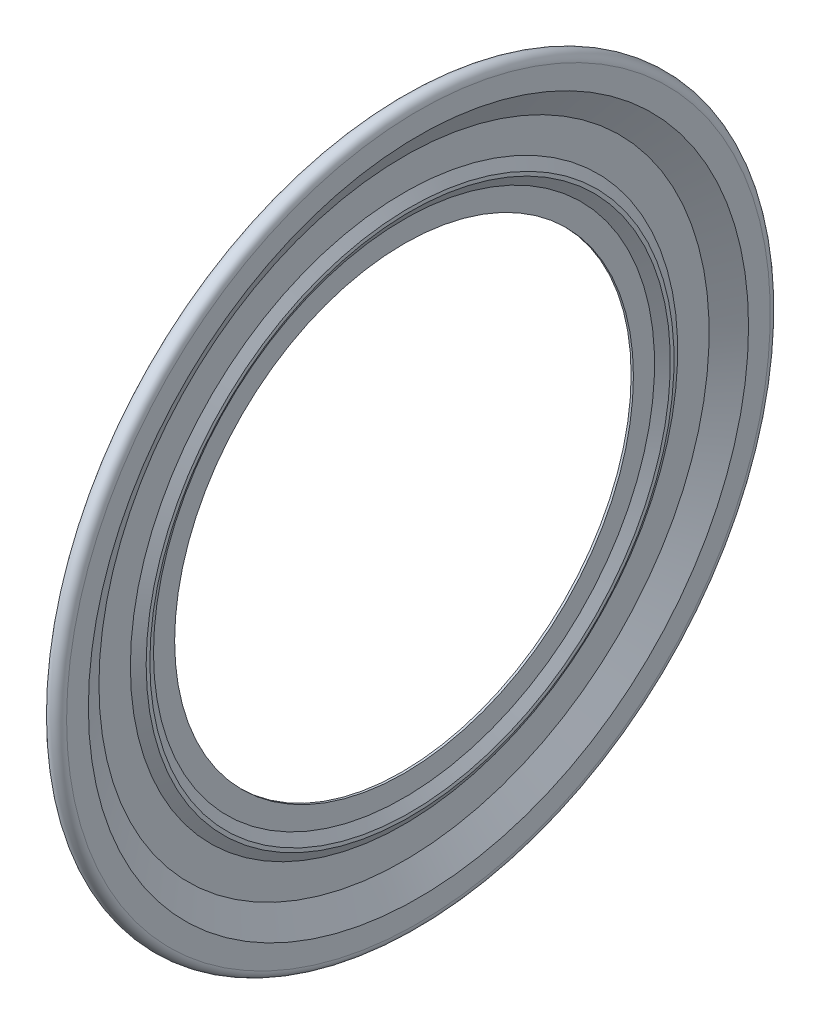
ISO-10303-21;
HEADER;
FILE_DESCRIPTION(('STEP AP214'),'2;1');
FILE_NAME('part.step','',(''),(''),'','','');
FILE_SCHEMA(('AUTOMOTIVE_DESIGN { 1 0 10303 214 1 1 1 1 }'));
ENDSEC;
DATA;
#1=APPLICATION_CONTEXT('core data for automotive mechanical design processes');
#2=APPLICATION_PROTOCOL_DEFINITION('international standard','automotive_design',2000,#1);
#3=PRODUCT_CONTEXT('',#1,'mechanical');
#4=PRODUCT('Part','Part','',(#3));
#5=PRODUCT_RELATED_PRODUCT_CATEGORY('part','',(#4));
#6=PRODUCT_DEFINITION_FORMATION('','',#4);
#7=PRODUCT_DEFINITION_CONTEXT('part definition',#1,'design');
#8=PRODUCT_DEFINITION('design','',#6,#7);
#9=PRODUCT_DEFINITION_SHAPE('','',#8);
#10=(LENGTH_UNIT() NAMED_UNIT(*) SI_UNIT(.MILLI.,.METRE.));
#11=(NAMED_UNIT(*) PLANE_ANGLE_UNIT() SI_UNIT($,.RADIAN.));
#12=(NAMED_UNIT(*) SI_UNIT($,.STERADIAN.) SOLID_ANGLE_UNIT());
#13=UNCERTAINTY_MEASURE_WITH_UNIT(LENGTH_MEASURE(1.E-05),#10,'distance_accuracy_value','');
#14=(GEOMETRIC_REPRESENTATION_CONTEXT(3) GLOBAL_UNCERTAINTY_ASSIGNED_CONTEXT((#13)) GLOBAL_UNIT_ASSIGNED_CONTEXT((#10,
#11,#12)) REPRESENTATION_CONTEXT('',''));
#15=CARTESIAN_POINT('',(0.,0.,0.));
#16=DIRECTION('',(0.,0.,1.));
#17=DIRECTION('',(1.,0.,0.));
#18=AXIS2_PLACEMENT_3D('',#15,#16,#17);
#19=CARTESIAN_POINT('',(0.183333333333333,0.,0.));
#20=DIRECTION('',(1.,0.,0.));
#21=DIRECTION('',(0.,0.,-1.));
#22=AXIS2_PLACEMENT_3D('',#19,#20,#21);
#23=CONICAL_SURFACE('',#22,13.4182689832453,1.0471975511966);
#24=CARTESIAN_POINT('',(0.816666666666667,0.,0.));
#25=DIRECTION('',(-1.,0.,0.));
#26=DIRECTION('',(0.,0.,1.));
#27=AXIS2_PLACEMENT_3D('',#24,#25,#26);
#28=CIRCLE('',#27,14.5152344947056);
#29=CARTESIAN_POINT('',(0.816666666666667,0.,14.5152344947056));
#30=VERTEX_POINT('',#29);
#31=EDGE_CURVE('E10',#30,#30,#28,.T.);
#32=ORIENTED_EDGE('',*,*,#31,.T.);
#33=EDGE_LOOP('',(#32));
#34=FACE_BOUND('',#33,.T.);
#35=CARTESIAN_POINT('',(0.183333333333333,0.,0.));
#36=DIRECTION('',(-1.,0.,0.));
#37=DIRECTION('',(0.,0.,1.));
#38=AXIS2_PLACEMENT_3D('',#35,#36,#37);
#39=CIRCLE('',#38,13.4182689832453);
#40=CARTESIAN_POINT('',(0.183333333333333,0.,13.4182689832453));
#41=VERTEX_POINT('',#40);
#42=EDGE_CURVE('E92',#41,#41,#39,.T.);
#43=ORIENTED_EDGE('',*,*,#42,.F.);
#44=EDGE_LOOP('',(#43));
#45=FACE_BOUND('',#44,.T.);
#46=ADVANCED_FACE('F28',(#34,#45),#23,.T.);
#47=CARTESIAN_POINT('',(0.816666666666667,14.5152344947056,0.));
#48=DIRECTION('',(-1.,0.,0.));
#49=DIRECTION('',(0.,0.,1.));
#50=AXIS2_PLACEMENT_3D('',#47,#48,#49);
#51=PLANE('',#50);
#52=CARTESIAN_POINT('',(0.816666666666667,0.,0.));
#53=DIRECTION('',(-1.,0.,0.));
#54=DIRECTION('',(0.,0.,1.));
#55=AXIS2_PLACEMENT_3D('',#52,#53,#54);
#56=CIRCLE('',#55,15.4441526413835);
#57=CARTESIAN_POINT('',(0.816666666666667,0.,15.4441526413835));
#58=VERTEX_POINT('',#57);
#59=EDGE_CURVE('E34',#58,#58,#56,.T.);
#60=ORIENTED_EDGE('',*,*,#59,.T.);
#61=EDGE_LOOP('',(#60));
#62=FACE_BOUND('',#61,.T.);
#63=ORIENTED_EDGE('',*,*,#31,.F.);
#64=EDGE_LOOP('',(#63));
#65=FACE_BOUND('',#64,.T.);
#66=ADVANCED_FACE('F100',(#62,#65),#51,.T.);
#67=CARTESIAN_POINT('',(0.55,0.,0.));
#68=DIRECTION('',(-1.,0.,0.));
#69=DIRECTION('',(0.,0.,1.));
#70=AXIS2_PLACEMENT_3D('',#67,#68,#69);
#71=TOROIDAL_SURFACE('',#70,15.4441526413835,0.266666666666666);
#72=CARTESIAN_POINT('',(0.283333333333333,0.,0.));
#73=DIRECTION('',(-1.,0.,0.));
#74=DIRECTION('',(0.,0.,1.));
#75=AXIS2_PLACEMENT_3D('',#72,#73,#74);
#76=CIRCLE('',#75,15.4441526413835);
#77=CARTESIAN_POINT('',(0.283333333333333,0.,15.4441526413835));
#78=VERTEX_POINT('',#77);
#79=EDGE_CURVE('E38',#78,#78,#76,.T.);
#80=ORIENTED_EDGE('',*,*,#79,.T.);
#81=EDGE_LOOP('',(#80));
#82=FACE_BOUND('',#81,.T.);
#83=ORIENTED_EDGE('',*,*,#59,.F.);
#84=EDGE_LOOP('',(#83));
#85=FACE_BOUND('',#84,.T.);
#86=ADVANCED_FACE('F104',(#82,#85),#71,.F.);
#87=CARTESIAN_POINT('',(0.283333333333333,15.4441526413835,0.));
#88=DIRECTION('',(1.,0.,0.));
#89=DIRECTION('',(0.,0.,-1.));
#90=AXIS2_PLACEMENT_3D('',#87,#88,#89);
#91=PLANE('',#90);
#92=CARTESIAN_POINT('',(0.283333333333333,0.,0.));
#93=DIRECTION('',(-1.,0.,0.));
#94=DIRECTION('',(0.,0.,1.));
#95=AXIS2_PLACEMENT_3D('',#92,#93,#94);
#96=CIRCLE('',#95,14.3752891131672);
#97=CARTESIAN_POINT('',(0.283333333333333,0.,14.3752891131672));
#98=VERTEX_POINT('',#97);
#99=EDGE_CURVE('E42',#98,#98,#96,.T.);
#100=ORIENTED_EDGE('',*,*,#99,.T.);
#101=EDGE_LOOP('',(#100));
#102=FACE_BOUND('',#101,.T.);
#103=ORIENTED_EDGE('',*,*,#79,.F.);
#104=EDGE_LOOP('',(#103));
#105=FACE_BOUND('',#104,.T.);
#106=ADVANCED_FACE('F108',(#102,#105),#91,.T.);
#107=CARTESIAN_POINT('',(0.,0.,0.));
#108=DIRECTION('',(-1.,0.,0.));
#109=DIRECTION('',(0.,0.,1.));
#110=AXIS2_PLACEMENT_3D('',#107,#108,#109);
#111=CYLINDRICAL_SURFACE('',#110,14.3752891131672);
#112=ORIENTED_EDGE('',*,*,#99,.F.);
#113=EDGE_LOOP('',(#112));
#114=FACE_BOUND('',#113,.T.);
#115=CARTESIAN_POINT('',(0.183333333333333,0.,0.));
#116=DIRECTION('',(-1.,0.,0.));
#117=DIRECTION('',(0.,0.,1.));
#118=AXIS2_PLACEMENT_3D('',#115,#116,#117);
#119=CIRCLE('',#118,14.3752891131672);
#120=CARTESIAN_POINT('',(0.183333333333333,0.,14.3752891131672));
#121=VERTEX_POINT('',#120);
#122=EDGE_CURVE('E47',#121,#121,#119,.T.);
#123=ORIENTED_EDGE('',*,*,#122,.T.);
#124=EDGE_LOOP('',(#123));
#125=FACE_BOUND('',#124,.T.);
#126=ADVANCED_FACE('F115',(#114,#125),#111,.F.);
#127=CARTESIAN_POINT('',(0.183333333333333,15.4441526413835,0.));
#128=DIRECTION('',(1.,0.,0.));
#129=DIRECTION('',(0.,0.,-1.));
#130=AXIS2_PLACEMENT_3D('',#127,#128,#129);
#131=PLANE('',#130);
#132=ORIENTED_EDGE('',*,*,#122,.F.);
#133=EDGE_LOOP('',(#132));
#134=FACE_BOUND('',#133,.T.);
#135=CARTESIAN_POINT('',(0.183333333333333,0.,0.));
#136=DIRECTION('',(-1.,0.,0.));
#137=DIRECTION('',(0.,0.,1.));
#138=AXIS2_PLACEMENT_3D('',#135,#136,#137);
#139=CIRCLE('',#138,15.4441526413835);
#140=CARTESIAN_POINT('',(0.183333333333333,0.,15.4441526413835));
#141=VERTEX_POINT('',#140);
#142=EDGE_CURVE('E50',#141,#141,#139,.T.);
#143=ORIENTED_EDGE('',*,*,#142,.T.);
#144=EDGE_LOOP('',(#143));
#145=FACE_BOUND('',#144,.T.);
#146=ADVANCED_FACE('F119',(#134,#145),#131,.F.);
#147=CARTESIAN_POINT('',(0.55,0.,0.));
#148=DIRECTION('',(-1.,0.,0.));
#149=DIRECTION('',(0.,0.,1.));
#150=AXIS2_PLACEMENT_3D('',#147,#148,#149);
#151=TOROIDAL_SURFACE('',#150,15.4441526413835,0.366666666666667);
#152=ORIENTED_EDGE('',*,*,#142,.F.);
#153=EDGE_LOOP('',(#152));
#154=FACE_BOUND('',#153,.T.);
#155=CARTESIAN_POINT('',(0.916666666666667,0.,0.));
#156=DIRECTION('',(-1.,0.,0.));
#157=DIRECTION('',(0.,0.,1.));
#158=AXIS2_PLACEMENT_3D('',#155,#156,#157);
#159=CIRCLE('',#158,15.4441526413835);
#160=CARTESIAN_POINT('',(0.916666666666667,0.,15.4441526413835));
#161=VERTEX_POINT('',#160);
#162=EDGE_CURVE('E53',#161,#161,#159,.T.);
#163=ORIENTED_EDGE('',*,*,#162,.T.);
#164=EDGE_LOOP('',(#163));
#165=FACE_BOUND('',#164,.T.);
#166=ADVANCED_FACE('F123',(#154,#165),#151,.T.);
#167=CARTESIAN_POINT('',(0.916666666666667,15.4441526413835,0.));
#168=DIRECTION('',(1.,0.,0.));
#169=DIRECTION('',(0.,0.,-1.));
#170=AXIS2_PLACEMENT_3D('',#167,#168,#169);
#171=PLANE('',#170);
#172=CARTESIAN_POINT('',(0.916666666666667,0.,0.));
#173=DIRECTION('',(-1.,0.,0.));
#174=DIRECTION('',(0.,0.,1.));
#175=AXIS2_PLACEMENT_3D('',#172,#173,#174);
#176=CIRCLE('',#175,14.4884395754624);
#177=CARTESIAN_POINT('',(0.916666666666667,0.,14.4884395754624));
#178=VERTEX_POINT('',#177);
#179=EDGE_CURVE('E56',#178,#178,#176,.T.);
#180=ORIENTED_EDGE('',*,*,#179,.T.);
#181=EDGE_LOOP('',(#180));
#182=FACE_BOUND('',#181,.T.);
#183=ORIENTED_EDGE('',*,*,#162,.F.);
#184=EDGE_LOOP('',(#183));
#185=FACE_BOUND('',#184,.T.);
#186=ADVANCED_FACE('F127',(#182,#185),#171,.T.);
#187=CARTESIAN_POINT('',(0.916666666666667,0.,0.));
#188=DIRECTION('',(1.,0.,0.));
#189=DIRECTION('',(0.,0.,-1.));
#190=AXIS2_PLACEMENT_3D('',#187,#188,#189);
#191=CONICAL_SURFACE('',#190,14.4884395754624,1.0471975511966);
#192=CARTESIAN_POINT('',(0.283333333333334,0.,0.));
#193=DIRECTION('',(-1.,0.,0.));
#194=DIRECTION('',(0.,0.,1.));
#195=AXIS2_PLACEMENT_3D('',#192,#193,#194);
#196=CIRCLE('',#195,13.3914740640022);
#197=CARTESIAN_POINT('',(0.283333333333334,0.,13.3914740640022));
#198=VERTEX_POINT('',#197);
#199=EDGE_CURVE('E59',#198,#198,#196,.T.);
#200=ORIENTED_EDGE('',*,*,#199,.T.);
#201=EDGE_LOOP('',(#200));
#202=FACE_BOUND('',#201,.T.);
#203=ORIENTED_EDGE('',*,*,#179,.F.);
#204=EDGE_LOOP('',(#203));
#205=FACE_BOUND('',#204,.T.);
#206=ADVANCED_FACE('F131',(#202,#205),#191,.F.);
#207=CARTESIAN_POINT('',(0.283333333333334,13.3914740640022,0.));
#208=DIRECTION('',(1.,0.,0.));
#209=DIRECTION('',(0.,0.,-1.));
#210=AXIS2_PLACEMENT_3D('',#207,#208,#209);
#211=PLANE('',#210);
#212=CARTESIAN_POINT('',(0.283333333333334,0.,0.));
#213=DIRECTION('',(-1.,0.,0.));
#214=DIRECTION('',(0.,0.,1.));
#215=AXIS2_PLACEMENT_3D('',#212,#213,#214);
#216=CIRCLE('',#215,12.0114542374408);
#217=CARTESIAN_POINT('',(0.283333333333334,0.,12.0114542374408));
#218=VERTEX_POINT('',#217);
#219=EDGE_CURVE('E62',#218,#218,#216,.T.);
#220=ORIENTED_EDGE('',*,*,#219,.T.);
#221=EDGE_LOOP('',(#220));
#222=FACE_BOUND('',#221,.T.);
#223=ORIENTED_EDGE('',*,*,#199,.F.);
#224=EDGE_LOOP('',(#223));
#225=FACE_BOUND('',#224,.T.);
#226=ADVANCED_FACE('F135',(#222,#225),#211,.T.);
#227=CARTESIAN_POINT('',(0.283333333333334,0.,0.));
#228=DIRECTION('',(-1.,0.,0.));
#229=DIRECTION('',(0.,0.,1.));
#230=AXIS2_PLACEMENT_3D('',#227,#228,#229);
#231=CONICAL_SURFACE('',#230,12.0114542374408,1.01153500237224);
#232=CARTESIAN_POINT('',(0.55,0.,0.));
#233=DIRECTION('',(-1.,0.,0.));
#234=DIRECTION('',(0.,0.,1.));
#235=AXIS2_PLACEMENT_3D('',#232,#233,#234);
#236=CIRCLE('',#235,11.5854153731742);
#237=CARTESIAN_POINT('',(0.55,0.,11.5854153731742));
#238=VERTEX_POINT('',#237);
#239=EDGE_CURVE('E65',#238,#238,#236,.T.);
#240=ORIENTED_EDGE('',*,*,#239,.T.);
#241=EDGE_LOOP('',(#240));
#242=FACE_BOUND('',#241,.T.);
#243=ORIENTED_EDGE('',*,*,#219,.F.);
#244=EDGE_LOOP('',(#243));
#245=FACE_BOUND('',#244,.T.);
#246=ADVANCED_FACE('F139',(#242,#245),#231,.T.);
#247=CARTESIAN_POINT('',(0.55,11.5854153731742,0.));
#248=DIRECTION('',(1.,0.,0.));
#249=DIRECTION('',(0.,0.,-1.));
#250=AXIS2_PLACEMENT_3D('',#247,#248,#249);
#251=PLANE('',#250);
#252=CARTESIAN_POINT('',(0.55,0.,0.));
#253=DIRECTION('',(-1.,0.,0.));
#254=DIRECTION('',(0.,0.,1.));
#255=AXIS2_PLACEMENT_3D('',#252,#253,#254);
#256=CIRCLE('',#255,11.4230420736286);
#257=CARTESIAN_POINT('',(0.55,0.,11.4230420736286));
#258=VERTEX_POINT('',#257);
#259=EDGE_CURVE('E68',#258,#258,#256,.T.);
#260=ORIENTED_EDGE('',*,*,#259,.T.);
#261=EDGE_LOOP('',(#260));
#262=FACE_BOUND('',#261,.T.);
#263=ORIENTED_EDGE('',*,*,#239,.F.);
#264=EDGE_LOOP('',(#263));
#265=FACE_BOUND('',#264,.T.);
#266=ADVANCED_FACE('F143',(#262,#265),#251,.T.);
#267=CARTESIAN_POINT('',(0.55,0.,0.));
#268=DIRECTION('',(1.,0.,0.));
#269=DIRECTION('',(0.,0.,-1.));
#270=AXIS2_PLACEMENT_3D('',#267,#268,#269);
#271=CONICAL_SURFACE('',#270,11.4230420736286,1.01153500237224);
#272=CARTESIAN_POINT('',(0.283333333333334,0.,0.));
#273=DIRECTION('',(-1.,0.,0.));
#274=DIRECTION('',(0.,0.,1.));
#275=AXIS2_PLACEMENT_3D('',#272,#273,#274);
#276=CIRCLE('',#275,10.997003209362);
#277=CARTESIAN_POINT('',(0.283333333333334,0.,10.997003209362));
#278=VERTEX_POINT('',#277);
#279=EDGE_CURVE('E71',#278,#278,#276,.T.);
#280=ORIENTED_EDGE('',*,*,#279,.T.);
#281=EDGE_LOOP('',(#280));
#282=FACE_BOUND('',#281,.T.);
#283=ORIENTED_EDGE('',*,*,#259,.F.);
#284=EDGE_LOOP('',(#283));
#285=FACE_BOUND('',#284,.T.);
#286=ADVANCED_FACE('F147',(#282,#285),#271,.F.);
#287=CARTESIAN_POINT('',(0.283333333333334,10.997003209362,0.));
#288=DIRECTION('',(1.,0.,0.));
#289=DIRECTION('',(0.,0.,-1.));
#290=AXIS2_PLACEMENT_3D('',#287,#288,#289);
#291=PLANE('',#290);
#292=CARTESIAN_POINT('',(0.283333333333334,0.,0.));
#293=DIRECTION('',(-1.,0.,0.));
#294=DIRECTION('',(0.,0.,1.));
#295=AXIS2_PLACEMENT_3D('',#292,#293,#294);
#296=CIRCLE('',#295,10.0686985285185);
#297=CARTESIAN_POINT('',(0.283333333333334,0.,10.0686985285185));
#298=VERTEX_POINT('',#297);
#299=EDGE_CURVE('E74',#298,#298,#296,.T.);
#300=ORIENTED_EDGE('',*,*,#299,.T.);
#301=EDGE_LOOP('',(#300));
#302=FACE_BOUND('',#301,.T.);
#303=ORIENTED_EDGE('',*,*,#279,.F.);
#304=EDGE_LOOP('',(#303));
#305=FACE_BOUND('',#304,.T.);
#306=ADVANCED_FACE('F151',(#302,#305),#291,.T.);
#307=CARTESIAN_POINT('',(0.,0.,0.));
#308=DIRECTION('',(-1.,0.,0.));
#309=DIRECTION('',(0.,0.,1.));
#310=AXIS2_PLACEMENT_3D('',#307,#308,#309);
#311=CYLINDRICAL_SURFACE('',#310,10.0686985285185);
#312=CARTESIAN_POINT('',(0.183333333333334,0.,0.));
#313=DIRECTION('',(-1.,0.,0.));
#314=DIRECTION('',(0.,0.,1.));
#315=AXIS2_PLACEMENT_3D('',#312,#313,#314);
#316=CIRCLE('',#315,10.0686985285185);
#317=CARTESIAN_POINT('',(0.183333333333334,0.,10.0686985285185));
#318=VERTEX_POINT('',#317);
#319=EDGE_CURVE('E77',#318,#318,#316,.T.);
#320=ORIENTED_EDGE('',*,*,#319,.T.);
#321=EDGE_LOOP('',(#320));
#322=FACE_BOUND('',#321,.T.);
#323=ORIENTED_EDGE('',*,*,#299,.F.);
#324=EDGE_LOOP('',(#323));
#325=FACE_BOUND('',#324,.T.);
#326=ADVANCED_FACE('F155',(#322,#325),#311,.F.);
#327=CARTESIAN_POINT('',(0.183333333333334,10.0686985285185,0.));
#328=DIRECTION('',(-1.,0.,0.));
#329=DIRECTION('',(0.,0.,1.));
#330=AXIS2_PLACEMENT_3D('',#327,#328,#329);
#331=PLANE('',#330);
#332=CARTESIAN_POINT('',(0.183333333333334,0.,0.));
#333=DIRECTION('',(-1.,0.,0.));
#334=DIRECTION('',(0.,0.,1.));
#335=AXIS2_PLACEMENT_3D('',#332,#333,#334);
#336=CIRCLE('',#335,11.0257186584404);
#337=CARTESIAN_POINT('',(0.183333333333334,0.,11.0257186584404));
#338=VERTEX_POINT('',#337);
#339=EDGE_CURVE('E80',#338,#338,#336,.T.);
#340=ORIENTED_EDGE('',*,*,#339,.T.);
#341=EDGE_LOOP('',(#340));
#342=FACE_BOUND('',#341,.T.);
#343=ORIENTED_EDGE('',*,*,#319,.F.);
#344=EDGE_LOOP('',(#343));
#345=FACE_BOUND('',#344,.T.);
#346=ADVANCED_FACE('F159',(#342,#345),#331,.T.);
#347=CARTESIAN_POINT('',(0.183333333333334,0.,0.));
#348=DIRECTION('',(1.,0.,0.));
#349=DIRECTION('',(0.,0.,-1.));
#350=AXIS2_PLACEMENT_3D('',#347,#348,#349);
#351=CONICAL_SURFACE('',#350,11.0257186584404,1.01153500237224);
#352=CARTESIAN_POINT('',(0.45,0.,0.));
#353=DIRECTION('',(-1.,0.,0.));
#354=DIRECTION('',(0.,0.,1.));
#355=AXIS2_PLACEMENT_3D('',#352,#353,#354);
#356=CIRCLE('',#355,11.4517575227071);
#357=CARTESIAN_POINT('',(0.45,0.,11.4517575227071));
#358=VERTEX_POINT('',#357);
#359=EDGE_CURVE('E83',#358,#358,#356,.T.);
#360=ORIENTED_EDGE('',*,*,#359,.T.);
#361=EDGE_LOOP('',(#360));
#362=FACE_BOUND('',#361,.T.);
#363=ORIENTED_EDGE('',*,*,#339,.F.);
#364=EDGE_LOOP('',(#363));
#365=FACE_BOUND('',#364,.T.);
#366=ADVANCED_FACE('F163',(#362,#365),#351,.T.);
#367=CARTESIAN_POINT('',(0.45,11.4517575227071,0.));
#368=DIRECTION('',(-1.,0.,0.));
#369=DIRECTION('',(0.,0.,1.));
#370=AXIS2_PLACEMENT_3D('',#367,#368,#369);
#371=PLANE('',#370);
#372=CARTESIAN_POINT('',(0.45,0.,0.));
#373=DIRECTION('',(-1.,0.,0.));
#374=DIRECTION('',(0.,0.,1.));
#375=AXIS2_PLACEMENT_3D('',#372,#373,#374);
#376=CIRCLE('',#375,11.5566999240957);
#377=CARTESIAN_POINT('',(0.45,0.,11.5566999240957));
#378=VERTEX_POINT('',#377);
#379=EDGE_CURVE('E86',#378,#378,#376,.T.);
#380=ORIENTED_EDGE('',*,*,#379,.T.);
#381=EDGE_LOOP('',(#380));
#382=FACE_BOUND('',#381,.T.);
#383=ORIENTED_EDGE('',*,*,#359,.F.);
#384=EDGE_LOOP('',(#383));
#385=FACE_BOUND('',#384,.T.);
#386=ADVANCED_FACE('F167',(#382,#385),#371,.T.);
#387=CARTESIAN_POINT('',(0.45,0.,0.));
#388=DIRECTION('',(-1.,0.,0.));
#389=DIRECTION('',(0.,0.,1.));
#390=AXIS2_PLACEMENT_3D('',#387,#388,#389);
#391=CONICAL_SURFACE('',#390,11.5566999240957,1.01153500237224);
#392=CARTESIAN_POINT('',(0.183333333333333,0.,0.));
#393=DIRECTION('',(-1.,0.,0.));
#394=DIRECTION('',(0.,0.,1.));
#395=AXIS2_PLACEMENT_3D('',#392,#393,#394);
#396=CIRCLE('',#395,11.9827387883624);
#397=CARTESIAN_POINT('',(0.183333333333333,0.,11.9827387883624));
#398=VERTEX_POINT('',#397);
#399=EDGE_CURVE('E89',#398,#398,#396,.T.);
#400=ORIENTED_EDGE('',*,*,#399,.T.);
#401=EDGE_LOOP('',(#400));
#402=FACE_BOUND('',#401,.T.);
#403=ORIENTED_EDGE('',*,*,#379,.F.);
#404=EDGE_LOOP('',(#403));
#405=FACE_BOUND('',#404,.T.);
#406=ADVANCED_FACE('F171',(#402,#405),#391,.F.);
#407=CARTESIAN_POINT('',(0.183333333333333,11.9827387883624,0.));
#408=DIRECTION('',(-1.,0.,0.));
#409=DIRECTION('',(0.,0.,1.));
#410=AXIS2_PLACEMENT_3D('',#407,#408,#409);
#411=PLANE('',#410);
#412=ORIENTED_EDGE('',*,*,#42,.T.);
#413=EDGE_LOOP('',(#412));
#414=FACE_BOUND('',#413,.T.);
#415=ORIENTED_EDGE('',*,*,#399,.F.);
#416=EDGE_LOOP('',(#415));
#417=FACE_BOUND('',#416,.T.);
#418=ADVANCED_FACE('F96',(#414,#417),#411,.T.);
#419=CLOSED_SHELL('',(#46,#66,#86,#106,#126,#146,#166,#186,#206,#226,#246,#266,#286,#306,#326,
#346,#366,#386,#406,#418));
#420=MANIFOLD_SOLID_BREP('B2',#419);
#421=ADVANCED_BREP_SHAPE_REPRESENTATION('',(#18,#420),#14);
#422=SHAPE_DEFINITION_REPRESENTATION(#9,#421);
ENDSEC;
END-ISO-10303-21;
